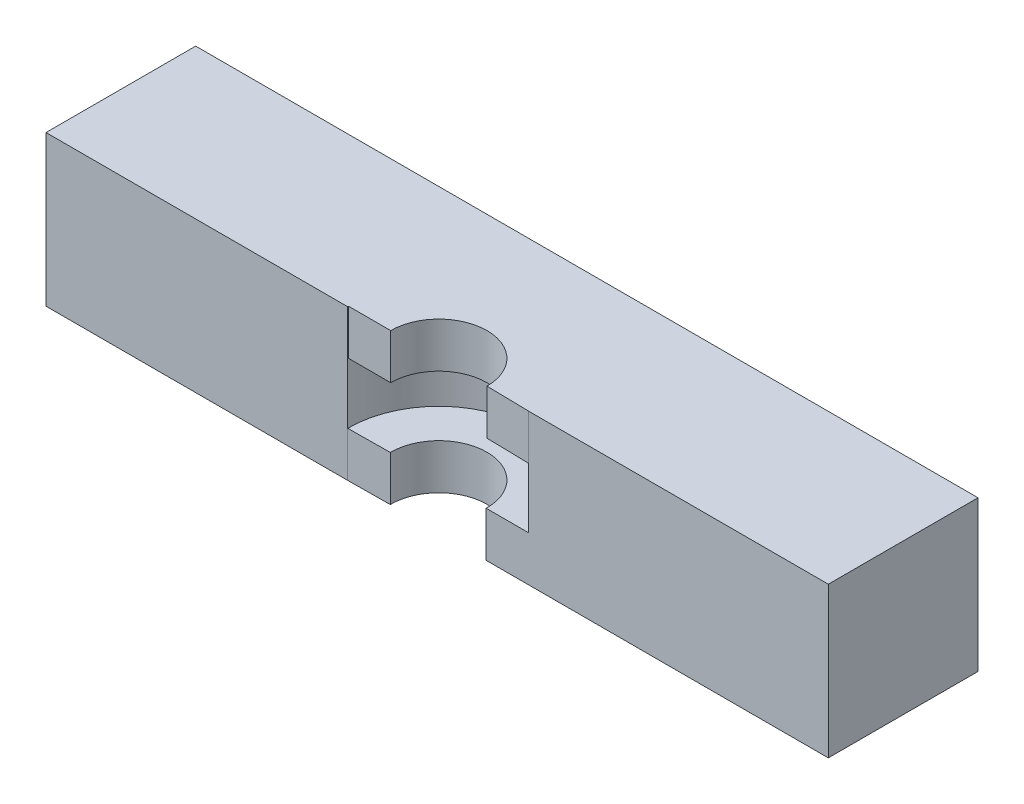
from build123d import *

# Parameters (mm, degrees)
SKETCH_1_W          = 0.7
SKETCH_1_H          = 0.7
EXTRUDE_1_DEPTH     = 0.5
SKETCH_2_W          = 2.6
SKETCH_2_H          = 2.6
EXTRUDE_2_DEPTH     = 0.5
SKETCH_3_R          = 0.3
CUT_EXTRUDE_1_DEPTH = 0.5
SKETCH_4_W          = 2.6
SKETCH_4_H          = 1.3
CUT_EXTRUDE_2_DEPTH = 0.5
EXTRUDE_START       = -0.15
EXTRUDE_6_DEPTH     = 0.15
EXTRUDE_7_DEPTH     = 0.15
SKETCH_7_W          = 2.6
SKETCH_7_H          = 0.802501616
CUT_EXTRUDE_3_DEPTH = 1.15


with BuildPart() as part:
    # Sketch 1 → Extrude 1 (new body)
    with BuildSketch(Plane(origin=(0, 0, 0), x_dir=(1, 0, 0), z_dir=(0, 1, 0))):
        with Locations((0.35, 0.35)):
            Rectangle(SKETCH_1_W, SKETCH_1_H)
    extrude(amount=EXTRUDE_1_DEPTH)

    # Sketch 2 → Extrude 2 (add)
    with BuildSketch(Plane(origin=(0, 0.5, 0), x_dir=(1, 0, 0), z_dir=(0, 1, 0))):
        with Locations((1.3, 1.3)):
            Rectangle(SKETCH_2_W, SKETCH_2_H)
    extrude(amount=-EXTRUDE_2_DEPTH)

    # Sketch 3 → Cut-Extrude 1 (cut)
    with BuildSketch(Plane(origin=(0, 0.5, 0), x_dir=(1, 0, 0), z_dir=(0, 1, 0))):
        with Locations(Location((1.302804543, 1.302804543, 0), (0, 0, 270))):
            Circle(SKETCH_3_R)
    extrude(amount=-CUT_EXTRUDE_1_DEPTH, mode=Mode.SUBTRACT)

    # Sketch 4 → Cut-Extrude 2 (cut)
    with BuildSketch(Plane.XZ):
        with Locations((1.3, -0.65)):
            Rectangle(SKETCH_4_W, SKETCH_4_H)
    extrude(amount=-CUT_EXTRUDE_2_DEPTH, mode=Mode.SUBTRACT)

    # Sketch 5 → Extrude 6 (add)
    with BuildSketch(Plane.XZ.offset(EXTRUDE_START)):
        with BuildLine():
            ThreePointArc((1.462804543, -1.302804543), (1.302065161, -1.462802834), (1.142811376, -1.301325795))
            Line((1.142811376, -1.301325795), (1.002817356, -1.300031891))
            ThreePointArc((1.002817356, -1.300031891), (1.301418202, -1.60280134), (1.602804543, -1.302804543))
            ThreePointArc((1.602804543, -1.302804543), (1.602801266, -1.301402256), (1.602791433, -1.3))
            Line((1.602791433, -1.3), (1.462779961, -1.3))
            ThreePointArc((1.462779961, -1.3), (1.462798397, -1.301402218), (1.462804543, -1.302804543))
        make_face()
    extrude(amount=EXTRUDE_6_DEPTH)

    # Sketch 6 → Extrude 7 (add)
    with BuildSketch(Plane(origin=(0, 0.5, 0), x_dir=(1, 0, 0), z_dir=(0, 1, 0))):
        with BuildLine():
            Line((1.002804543, 1.302804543), (1.142804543, 1.302804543))
            ThreePointArc((1.142804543, 1.302804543), (1.302804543, 1.462804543), (1.462804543, 1.302804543))
            Line((1.462804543, 1.302804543), (1.602791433, 1.3))
            ThreePointArc((1.602791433, 1.3), (1.602801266, 1.301402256), (1.602804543, 1.302804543))
            ThreePointArc((1.602804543, 1.302804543), (1.302804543, 1.602804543), (1.002804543, 1.302804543))
        make_face()
    extrude(amount=-EXTRUDE_7_DEPTH)

    # Sketch 7 → Cut-Extrude 3 (cut)
    with BuildSketch(Plane.XZ):
        with Locations((1.3, -2.198749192)):
            Rectangle(SKETCH_7_W, SKETCH_7_H)
    extrude(amount=-CUT_EXTRUDE_3_DEPTH, mode=Mode.SUBTRACT)


solid = part.part
